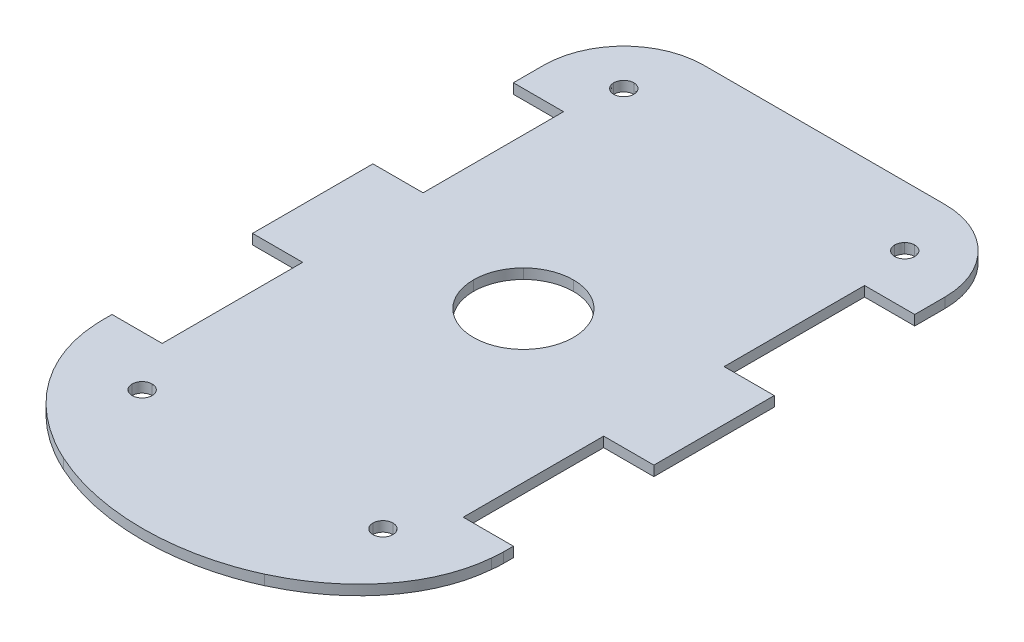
from build123d import *

# Parameters (mm, degrees)
BOSS_EXTRUDE1_DEPTH = 5


with BuildPart() as part:
    # Model → Boss-Extrude1 (new body)
    with BuildSketch(Plane(origin=(0, 0, 0), x_dir=(1, 0, 0), z_dir=(0, 1, 0))):
        with BuildLine():
            Line((50.000048, 360.000047), (50.000048, 344.999929))
            Line((50.000048, 344.999929), (75.000071, 344.999929))
            Line((75.000071, 344.999929), (75.000071, 275.000067))
            Line((75.000071, 275.000067), (50.000048, 275.000067))
            Line((50.000048, 275.000067), (50.000048, 215.000114))
            Line((50.000048, 215.000114), (75.000071, 215.000114))
            Line((75.000071, 215.000114), (75.000071, 145.000262))
            Line((75.000071, 145.000262), (50.000048, 145.000262))
            Line((50.000048, 145.000262), (50.000048, 140.000034))
            add(Edge.make_bspline(
                [(50.000048, 140.000034), (50.000048, 139.033062), (50.036068, 138.074688), (50.102883, 137.125284)],
                knots=[0, 0, 0, 0, 1, 1, 1, 1], degree=3))
            add(Edge.make_bspline(
                [(50.102883, 137.125284), (51.340476, 109.663561), (70.194379, 84.642167), (100.006815, 70.896769)],
                knots=[0, 0, 0, 0, 1, 1, 1, 1], degree=3))
            add(Edge.make_bspline(
                [(100.006815, 70.896769), (130.94023, 56.642331), (169.051792, 56.642331), (199.985207, 70.896769)],
                knots=[0, 0, 0, 0, 1, 1, 1, 1], degree=3))
            add(Edge.make_bspline(
                [(199.985207, 70.896769), (228.771136, 84.201559), (247.381121, 108.061961), (249.632305, 134.550755)],
                knots=[0, 0, 0, 0, 1, 1, 1, 1], degree=3))
            add(Edge.make_bspline(
                [(249.632305, 134.550755), (249.872963, 136.332142), (250.00024, 138.150623), (250.00024, 140.000034)],
                knots=[0, 0, 0, 0, 1, 1, 1, 1], degree=3))
            Line((250.00024, 140.000034), (250.00024, 144.999733))
            Line((250.00024, 144.999733), (225.000217, 144.999733))
            Line((225.000217, 144.999733), (225.000217, 215.000114))
            Line((225.000217, 215.000114), (250.00024, 215.000114))
            Line((250.00024, 215.000114), (250.00024, 275.000067))
            Line((250.00024, 275.000067), (225.000217, 275.000067))
            Line((225.000217, 275.000067), (225.000217, 344.999929))
            Line((225.000217, 344.999929), (250.00024, 344.999929))
            Line((250.00024, 344.999929), (250.00024, 360.000047))
            add(Edge.make_bspline(
                [(250.00024, 360.000047), (250.00024, 382.160007), (232.160085, 400.000187), (210.000099, 400.000187)],
                knots=[0, 0, 0, 0, 1, 1, 1, 1], degree=3))
            Line((210.000099, 400.000187), (90.000189, 400.000187))
            add(Edge.make_bspline(
                [(90.000189, 400.000187), (67.840206, 400.000187), (50.000048, 382.160007), (50.000048, 360.000047)],
                knots=[0, 0, 0, 0, 1, 1, 1, 1], degree=3))
        make_face()
        with BuildLine():
            add(Edge.make_bspline(
                [(79.999768, 375.000165), (81.325924, 375.000221), (82.59778, 374.473432), (83.535514, 373.535699)],
                knots=[0, 0, 0, 0, 1, 1, 1, 1], degree=3))
            add(Edge.make_bspline(
                [(83.535514, 373.535699), (84.473248, 372.597965), (85.000036, 371.326108), (84.99998, 369.999952)],
                knots=[0, 0, 0, 0, 1, 1, 1, 1], degree=3))
            add(Edge.make_bspline(
                [(84.99998, 369.999952), (84.999812, 367.238564), (82.761156, 365.000139), (79.999768, 365.000256)],
                knots=[0, 0, 0, 0, 1, 1, 1, 1], degree=3))
            add(Edge.make_bspline(
                [(79.999768, 365.000256), (77.238581, 365.000424), (75.000239, 367.238766), (75.000071, 369.999952)],
                knots=[0, 0, 0, 0, 1, 1, 1, 1], degree=3))
            add(Edge.make_bspline(
                [(75.000071, 369.999952), (74.999954, 372.76134), (77.23838, 374.999997), (79.999768, 375.000165)],
                knots=[0, 0, 0, 0, 1, 1, 1, 1], degree=3))
        make_face(mode=Mode.SUBTRACT)
        with BuildLine():
            add(Edge.make_bspline(
                [(220.000004, 375.000165), (221.32616, 375.000221), (222.598017, 374.473432), (223.53575, 373.535699)],
                knots=[0, 0, 0, 0, 1, 1, 1, 1], degree=3))
            add(Edge.make_bspline(
                [(223.53575, 373.535699), (224.473484, 372.597965), (225.000273, 371.326108), (225.000217, 369.999952)],
                knots=[0, 0, 0, 0, 1, 1, 1, 1], degree=3))
            add(Edge.make_bspline(
                [(225.000217, 369.999952), (225.000049, 367.238564), (222.761392, 365.000139), (220.000004, 365.000256)],
                knots=[0, 0, 0, 0, 1, 1, 1, 1], degree=3))
            add(Edge.make_bspline(
                [(220.000004, 365.000256), (217.238617, 365.00014), (214.999963, 367.238566), (214.999795, 369.999952)],
                knots=[0, 0, 0, 0, 1, 1, 1, 1], degree=3))
            add(Edge.make_bspline(
                [(214.999795, 369.999952), (214.999739, 371.326108), (215.526527, 372.597964), (216.46426, 373.535698)],
                knots=[0, 0, 0, 0, 1, 1, 1, 1], degree=3))
            add(Edge.make_bspline(
                [(216.46426, 373.535698), (217.401993, 374.473431), (218.673849, 375.00022), (220.000004, 375.000165)],
                knots=[0, 0, 0, 0, 1, 1, 1, 1], degree=3))
        make_face(mode=Mode.SUBTRACT)
        with BuildLine():
            add(Edge.make_bspline(
                [(150.000145, 274.87966), (163.740732, 274.879563), (174.879657, 263.740639), (174.879762, 250.000043)],
                knots=[0, 0, 0, 0, 1, 1, 1, 1], degree=3))
            add(Edge.make_bspline(
                [(174.879762, 250.000043), (174.879657, 236.259448), (163.740732, 225.120523), (150.000145, 225.120426)],
                knots=[0, 0, 0, 0, 1, 1, 1, 1], degree=3))
            add(Edge.make_bspline(
                [(150.000145, 225.120426), (143.401588, 225.120335), (137.073256, 227.741527), (132.407321, 232.407364)],
                knots=[0, 0, 0, 0, 1, 1, 1, 1], degree=3))
            add(Edge.make_bspline(
                [(132.407321, 232.407364), (127.741386, 237.073202), (125.12006, 243.401481), (125.120009, 250.000043)],
                knots=[0, 0, 0, 0, 1, 1, 1, 1], degree=3))
            add(Edge.make_bspline(
                [(125.120009, 250.000043), (125.12006, 256.598605), (127.741386, 262.926884), (132.407321, 267.592722)],
                knots=[0, 0, 0, 0, 1, 1, 1, 1], degree=3))
            add(Edge.make_bspline(
                [(132.407321, 267.592722), (137.073256, 272.25856), (143.401588, 274.879751), (150.000145, 274.87966)],
                knots=[0, 0, 0, 0, 1, 1, 1, 1], degree=3))
        make_face(mode=Mode.SUBTRACT)
        with BuildLine():
            add(Edge.make_bspline(
                [(90.000189, 124.999932), (92.761377, 124.999765), (94.999719, 122.761421), (94.999886, 120.000233)],
                knots=[0, 0, 0, 0, 1, 1, 1, 1], degree=3))
            add(Edge.make_bspline(
                [(94.999886, 120.000233), (95.000011, 117.238839), (92.761583, 115.000173), (90.000189, 115.000005)],
                knots=[0, 0, 0, 0, 1, 1, 1, 1], degree=3))
            add(Edge.make_bspline(
                [(90.000189, 115.000005), (88.674031, 114.99995), (87.402173, 115.526741), (86.464439, 116.464478)],
                knots=[0, 0, 0, 0, 1, 1, 1, 1], degree=3))
            add(Edge.make_bspline(
                [(86.464439, 116.464478), (85.526706, 117.402215), (84.999919, 118.674075), (84.99998, 120.000233)],
                knots=[0, 0, 0, 0, 1, 1, 1, 1], degree=3))
            add(Edge.make_bspline(
                [(84.99998, 120.000233), (85.000146, 122.761621), (87.238801, 125.000048), (90.000189, 124.999932)],
                knots=[0, 0, 0, 0, 1, 1, 1, 1], degree=3))
        make_face(mode=Mode.SUBTRACT)
        with BuildLine():
            add(Edge.make_bspline(
                [(210.000099, 124.999932), (212.761286, 124.999765), (214.999629, 122.761421), (214.999795, 120.000233)],
                knots=[0, 0, 0, 0, 1, 1, 1, 1], degree=3))
            add(Edge.make_bspline(
                [(214.999795, 120.000233), (214.999921, 117.238839), (212.761493, 115.000173), (210.000099, 115.000005)],
                knots=[0, 0, 0, 0, 1, 1, 1, 1], degree=3))
            add(Edge.make_bspline(
                [(210.000099, 115.000005), (208.67394, 114.999949), (207.402081, 115.52674), (206.464347, 116.464477)],
                knots=[0, 0, 0, 0, 1, 1, 1, 1], degree=3))
            add(Edge.make_bspline(
                [(206.464347, 116.464477), (205.526613, 117.402214), (204.999826, 118.674075), (204.999886, 120.000233)],
                knots=[0, 0, 0, 0, 1, 1, 1, 1], degree=3))
            add(Edge.make_bspline(
                [(204.999886, 120.000233), (205.000053, 122.761622), (207.23871, 125.000049), (210.000099, 124.999932)],
                knots=[0, 0, 0, 0, 1, 1, 1, 1], degree=3))
        make_face(mode=Mode.SUBTRACT)
    extrude(amount=BOSS_EXTRUDE1_DEPTH)


solid = part.part
